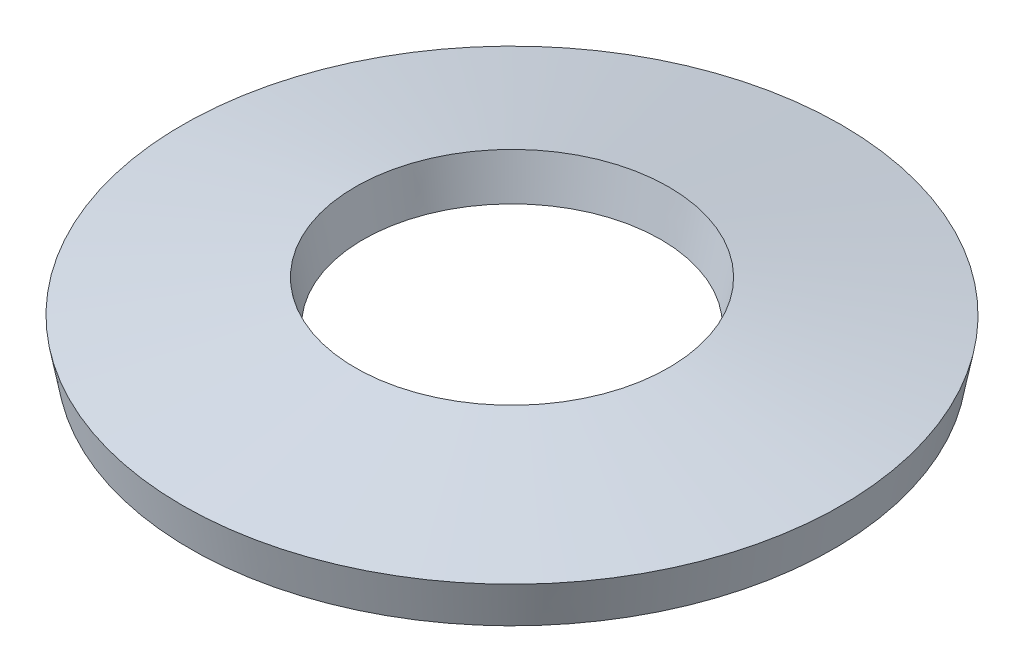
from build123d import *


with BuildPart() as part:
    # Sketch1 → Revolve1 (revolve)
    with BuildSketch(Plane.XY, mode=Mode.PRIVATE) as revolve1_sk:
        Polygon((3.477178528, 1.651), (7.312578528, 0.923329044), (7.1374, 0), (3.302, 0.727670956), align=None)
    revolve(revolve1_sk.sketch.rotate(Axis((0, 0, 0), (0, 1, 0)), 90), axis=Axis((0, 0, 0), (0, 1, 0)))


solid = part.part
